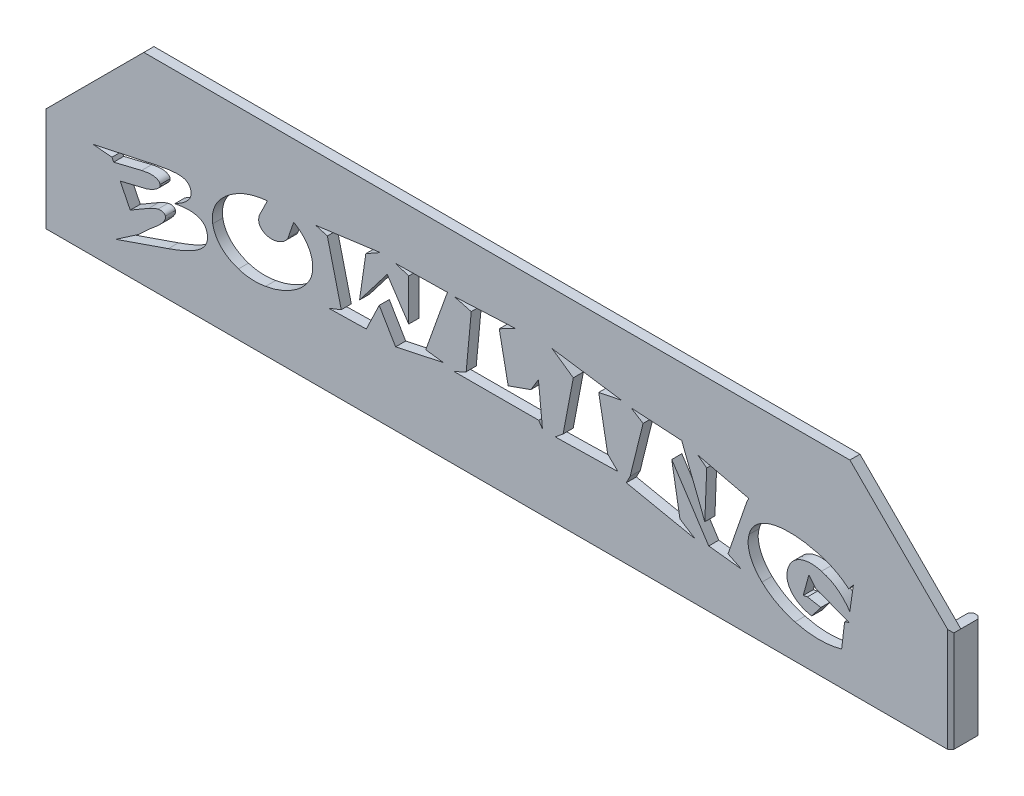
from build123d import *

# Parameters (mm, degrees)
BOSS_EXTRU_1_DEPTH      = 2
ENL_V_MAT_EXTRU_3_DEPTH = 10
ESQUISSE6_W             = 2
ESQUISSE6_H             = 20
BOSS_EXTRU_2_DEPTH      = 4
CHANFREIN1_SIZE         = 0.6


with BuildPart() as part:
    # Esquisse1 → Boss.-Extru.1 (new body)
    with BuildSketch(Plane.XY):
        Polygon((-90, 0), (90, 0), (90, 20), (70, 40), (-70, 40), (-90, 20), align=None)
    extrude(amount=BOSS_EXTRU_1_DEPTH)

    # Esquisse5 → Enl_v. mat.-Extru.3 (cut)
    with BuildSketch(Plane.XY.offset(2)):
        with BuildLine():
            Line((-65.13450329, 8.732218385), (-75.524175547, 5.136562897))
            Line((-75.524175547, 5.136562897), (-71.028177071, 8.226311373))
            Line((-71.028177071, 8.226311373), (-68.687285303, 10.401425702))
            add(Edge.make_bspline(
                [(-68.687285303, 10.401425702), (-68.428409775, 10.604698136), (-68.056893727, 10.905267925), (-67.589815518, 11.309111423), (-67.279108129, 11.588260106), (-66.994943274, 11.853941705), (-66.740007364, 12.108085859), (-66.514648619, 12.350787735), (-66.315874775, 12.579409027), (-66.145454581, 12.797559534), (-66.003835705, 13.005634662), (-65.883319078, 13.200111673), (-65.794696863, 13.385269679), (-65.73272996, 13.559562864), (-65.686047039, 13.769025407), (-65.691991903, 13.924687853), (-65.714724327, 14.019947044)],
                knots=[0, 0, 0, 0, 0.204199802, 0.296389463, 0.383025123, 0.46330879, 0.537702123, 0.606290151, 0.668732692, 0.725600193, 0.777897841, 0.824830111, 0.867394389, 0.904967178, 0.939395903, 1, 1, 1, 1], degree=3))
            add(Edge.make_bspline(
                [(-65.714724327, 14.019947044), (-65.743527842, 14.130607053), (-65.836961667, 14.288511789), (-66.043519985, 14.424958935), (-66.235972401, 14.502203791), (-66.457391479, 14.549341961), (-66.790686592, 14.568236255), (-67.046563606, 14.526508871), (-67.218154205, 14.48298058)],
                knots=[0, 0, 0, 0, 0.198118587, 0.30248799, 0.423844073, 0.555583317, 0.692800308, 1, 1, 1, 1], degree=3))
            add(Edge.make_bspline(
                [(-67.218154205, 14.48298058), (-67.511841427, 14.408046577), (-67.958206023, 14.237825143), (-68.559145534, 13.959921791), (-68.875938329, 13.790025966), (-69.035989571, 13.696966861)],
                knots=[0, 0, 0, 0, 0.457042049, 0.72046758, 1, 1, 1, 1], degree=3))
            Line((-69.035989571, 13.696966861), (-72.69590623, 11.568969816))
            Line((-72.69590623, 11.568969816), (-74.687422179, 15.560599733))
            Line((-74.687422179, 15.560599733), (-69.41899262, 16.84387997))
            add(Edge.make_bspline(
                [(-69.41899262, 16.84387997), (-69.023699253, 16.986915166), (-68.46614836, 17.214469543), (-67.799063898, 17.588162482), (-67.456972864, 17.827714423), (-67.224605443, 18.023549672), (-67.081239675, 18.162238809), (-66.96533043, 18.29871223), (-66.872325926, 18.428287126), (-66.807768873, 18.556487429), (-66.756154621, 18.716894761), (-66.761588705, 18.840570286), (-66.777986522, 18.916097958)],
                knots=[0, 0, 0, 0, 0.355459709, 0.507236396, 0.645273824, 0.707532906, 0.763891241, 0.813575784, 0.858686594, 0.898289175, 0.934453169, 1, 1, 1, 1], degree=3))
            add(Edge.make_bspline(
                [(-66.777986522, 18.916097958), (-66.803763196, 19.021834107), (-66.874553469, 19.170612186), (-67.012719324, 19.341417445), (-67.144095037, 19.451079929), (-67.301380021, 19.542366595), (-67.483081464, 19.619058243), (-67.688944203, 19.68169857), (-67.9190049, 19.72573712), (-68.169104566, 19.757298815), (-68.439406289, 19.770802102), (-68.727642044, 19.767714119), (-69.034592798, 19.746064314), (-69.359941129, 19.712617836), (-69.704035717, 19.660066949), (-70.066303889, 19.591443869), (-70.313165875, 19.535637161), (-70.439381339, 19.50489369)],
                knots=[0, 0, 0, 0, 0.080611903, 0.120925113, 0.162690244, 0.207200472, 0.255804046, 0.309189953, 0.36704195, 0.429928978, 0.496679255, 0.568302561, 0.64433919, 0.725623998, 0.811668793, 0.903319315, 1, 1, 1, 1], degree=3))
            Line((-70.439381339, 19.50489369), (-75.981769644, 18.15488278))
            Line((-75.981769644, 18.15488278), (-76.324480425, 18.841783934))
            Line((-76.324480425, 18.841783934), (-80.10020451, 19.17048058))
            Line((-80.10020451, 19.17048058), (-67.649747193, 21.860076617))
            add(Edge.make_bspline(
                [(-67.649747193, 21.860076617), (-67.098878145, 21.981133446), (-66.302307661, 22.134066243), (-65.279073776, 22.301071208), (-64.608949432, 22.387608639), (-64.000631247, 22.442450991), (-63.457028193, 22.470916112), (-62.975913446, 22.465905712), (-62.553984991, 22.434597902), (-62.18137105, 22.368649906), (-61.850638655, 22.272985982), (-61.558297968, 22.144671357), (-61.305087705, 21.983010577), (-61.091491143, 21.789169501), (-60.848925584, 21.487106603), (-60.74053512, 21.211612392), (-60.689952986, 21.022614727)],
                knots=[0, 0, 0, 0, 0.221363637, 0.318320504, 0.406917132, 0.486516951, 0.558024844, 0.620482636, 0.675266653, 0.723901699, 0.768748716, 0.810099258, 0.848792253, 0.886123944, 0.922860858, 1, 1, 1, 1], degree=3))
            add(Edge.make_bspline(
                [(-60.689952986, 21.022614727), (-60.649201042, 20.85747048), (-60.611952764, 20.603114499), (-60.636297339, 20.264036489), (-60.685730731, 20.0127296), (-60.766437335, 19.76200604), (-60.881689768, 19.512630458), (-61.031961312, 19.266551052), (-61.214234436, 19.022994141), (-61.426612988, 18.77769136), (-61.677774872, 18.537164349), (-61.956637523, 18.289877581), (-62.2734066, 18.047901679), (-62.622396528, 17.804619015), (-63.151337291, 17.472539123), (-63.569019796, 17.230139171), (-63.865448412, 17.081113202)],
                knots=[0, 0, 0, 0, 0.093707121, 0.139930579, 0.186385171, 0.234280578, 0.284460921, 0.337127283, 0.392572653, 0.451632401, 0.515372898, 0.583700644, 0.656551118, 0.734472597, 0.81763157, 1, 1, 1, 1], degree=3))
            add(Edge.make_bspline(
                [(-63.865448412, 17.081113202), (-63.431587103, 17.174871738), (-62.794833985, 17.279259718), (-61.965159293, 17.374889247), (-61.398227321, 17.404827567), (-60.865889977, 17.409607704), (-60.368916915, 17.38336599), (-59.907780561, 17.319505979), (-59.482339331, 17.230515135), (-59.095092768, 17.106718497), (-58.742567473, 16.957729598), (-58.432203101, 16.770250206), (-58.160437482, 16.554841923), (-57.927020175, 16.309050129), (-57.671636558, 15.930456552), (-57.544468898, 15.607507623), (-57.485875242, 15.383323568)],
                knots=[0, 0, 0, 0, 0.182781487, 0.265700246, 0.343927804, 0.416542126, 0.484950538, 0.548730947, 0.6081639, 0.66377496, 0.71598391, 0.765459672, 0.812659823, 0.858475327, 0.904525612, 1, 1, 1, 1], degree=3))
            add(Edge.make_bspline(
                [(-57.485875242, 15.383323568), (-57.404472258, 15.072708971), (-57.344069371, 14.595914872), (-57.413456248, 13.969054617), (-57.539600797, 13.520576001), (-57.733662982, 13.084316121), (-58.000186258, 12.66184647), (-58.338617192, 12.254168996), (-58.75126669, 11.860404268), (-59.241681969, 11.471313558), (-59.819349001, 11.084127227), (-60.485679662, 10.695002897), (-61.241442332, 10.302645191), (-62.087046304, 9.911833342), (-63.383513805, 9.35823904), (-64.416417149, 8.982683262), (-65.13450329, 8.732218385)],
                knots=[0, 0, 0, 0, 0.086801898, 0.12825484, 0.169667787, 0.212198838, 0.256845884, 0.304215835, 0.355015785, 0.410703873, 0.4731853, 0.542773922, 0.61912104, 0.703203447, 0.794445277, 1, 1, 1, 1], degree=3))
        make_face()
        Polygon((-10.18802533, 27.847546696), (-14.095228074, 16.886228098), (-10.611043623, 16.431769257), (-20.080365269, 14.390991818), (-23.327316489, 19.90166255), (-25.894008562, 14.54533633), (-33.319694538, 14.396708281), (-30.855898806, 15.38279822), (-33.614092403, 26.664238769), (-35.923543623, 27.344497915), (-23.101516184, 29.070869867), (-25.985471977, 27.450252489), (-27.234519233, 18.855549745), (-21.743856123, 26.026853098), (-17.476516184, 19.598689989), (-17.476516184, 27.864696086), (-20.108947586, 28.72502383), (-9.77506906, 28.894431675), align=None)
        Polygon((9.043616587, 14.835604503), (8.306081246, 15.97926476), (-8.417432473, 15.956398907), (-6.087973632, 17.102549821), (-5.079017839, 27.949539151), (-8.463164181, 28.849882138), (3.695753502, 29.432961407), (0.465951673, 27.766612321), (2.240913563, 18.863220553), (6.728337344, 20.446680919), (8.240341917, 22.927626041), align=None)
        Polygon((24.013328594, 15.011597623), (11.578769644, 14.759932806), (13.134551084, 16.038920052), (15.158179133, 26.697266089), (10.950862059, 29.615520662), (24.729667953, 27.624936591), (20.197241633, 26.708699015), (21.977919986, 17.005002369), align=None)
        Polygon((49.956832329, 23.383358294), (49.582721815, 22.656325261), (45.835580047, 11.815052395), (48.465153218, 10.514556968), (42.014124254, 11.246264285), (34.67418523, 22.427666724), (36.309093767, 13.01265148), (39.318811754, 11.114785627), (25.665689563, 13.925723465), (26.427868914, 15.42604122), (28.991702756, 25.787131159), (26.630275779, 27.263524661), (36.646047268, 26.673182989), (41.233509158, 15.011597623), (41.610795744, 24.440904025), (39.792960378, 25.795705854), align=None)
        with BuildLine():
            Line((69.867169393, 12.037438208), (68.94326422, 11.679878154))
            Line((68.94326422, 11.679878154), (68.363043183, 6.709413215))
            add(Edge.make_bspline(
                [(68.363043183, 6.709413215), (67.605404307, 6.506307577), (66.455011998, 6.277967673), (64.907979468, 6.128195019), (63.754413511, 6.092544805), (62.599967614, 6.139816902), (61.041160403, 6.305065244), (59.881853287, 6.550415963), (59.113805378, 6.755144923)],
                knots=[0, 0, 0, 0, 0.251400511, 0.375055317, 0.497884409, 0.621061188, 0.745143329, 1, 1, 1, 1], degree=3))
            add(Edge.make_bspline(
                [(59.113805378, 6.755144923), (58.484983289, 6.925666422), (57.558436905, 7.228033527), (56.37406927, 7.744221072), (55.52021652, 8.170406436), (54.707073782, 8.642976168), (53.696065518, 9.326484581), (52.991720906, 9.898374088), (52.559880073, 10.313643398)],
                knots=[0, 0, 0, 0, 0.259529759, 0.387329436, 0.514260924, 0.639410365, 0.761595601, 1, 1, 1, 1], degree=3))
            add(Edge.make_bspline(
                [(52.559880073, 10.313643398), (52.292576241, 10.578790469), (51.901241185, 10.976805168), (51.442758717, 11.547356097), (51.13097986, 11.970976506), (50.855010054, 12.402537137), (50.607368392, 12.837874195), (50.392720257, 13.278973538), (50.208825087, 13.724315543), (50.061645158, 14.17177478), (49.944138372, 14.616997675), (49.869393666, 15.060149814), (49.820879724, 15.500078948), (49.812295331, 15.937242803), (49.85288317, 16.51621829), (49.926190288, 16.945291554), (50.004620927, 17.224847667)],
                knots=[0, 0, 0, 0, 0.146092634, 0.215955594, 0.28363402, 0.34992934, 0.414440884, 0.477714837, 0.540000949, 0.601093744, 0.66022532, 0.718343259, 0.775168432, 0.831696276, 0.887596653, 1, 1, 1, 1], degree=3))
            add(Edge.make_bspline(
                [(50.004620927, 17.224847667), (50.073896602, 17.484769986), (50.206694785, 17.864913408), (50.445674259, 18.341238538), (50.649844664, 18.680640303), (50.880325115, 19.004303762), (51.143609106, 19.307289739), (51.429128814, 19.597791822), (51.74478508, 19.868637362), (52.084672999, 20.122679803), (52.447791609, 20.358020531), (52.836292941, 20.568553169), (53.244981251, 20.763762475), (53.678404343, 20.938185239), (54.296608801, 21.146937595), (54.780768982, 21.262690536), (55.109422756, 21.33212663)],
                knots=[0, 0, 0, 0, 0.116605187, 0.173858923, 0.230731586, 0.288148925, 0.345843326, 0.404540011, 0.464564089, 0.525932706, 0.588363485, 0.651942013, 0.717334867, 0.784590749, 0.854329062, 1, 1, 1, 1], degree=3))
            add(Edge.make_bspline(
                [(55.109422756, 21.33212663), (55.762182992, 21.468305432), (56.768329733, 21.589932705), (58.13634771, 21.632297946), (59.20612216, 21.595241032), (60.308609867, 21.499295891), (61.848073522, 21.268863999), (63.009021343, 21.012908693), (63.78701422, 20.800495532)],
                knots=[0, 0, 0, 0, 0.227878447, 0.345900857, 0.467842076, 0.593793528, 0.724218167, 1, 1, 1, 1], degree=3))
            add(Edge.make_bspline(
                [(63.78701422, 20.800495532), (64.371318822, 20.641343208), (65.229205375, 20.371736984), (66.323233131, 19.916718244), (67.100038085, 19.551628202), (67.832840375, 19.147196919), (68.743366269, 18.585715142), (69.369862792, 18.101230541), (69.760718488, 17.759336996)],
                knots=[0, 0, 0, 0, 0.268827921, 0.398299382, 0.525575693, 0.649511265, 0.769527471, 1, 1, 1, 1], degree=3))
            Line((69.760718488, 17.759336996), (70.686785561, 18.899771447))
            Line((70.686785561, 18.899771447), (69.982395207, 13.925723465))
            add(Edge.make_bspline(
                [(69.982395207, 13.925723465), (69.891331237, 14.111452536), (69.652026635, 14.405173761), (69.323337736, 14.835321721), (69.000683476, 15.214908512), (68.668195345, 15.569051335), (68.330948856, 15.902313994), (67.984834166, 16.210417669), (67.631728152, 16.498456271), (67.268230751, 16.764611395), (66.892093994, 17.011247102), (66.504085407, 17.239611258), (66.102871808, 17.449480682), (65.687744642, 17.636774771), (65.116555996, 17.868369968), (64.672912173, 18.007875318), (64.37295172, 18.090891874)],
                knots=[0, 0, 0, 0, 0.08657316, 0.157745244, 0.227509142, 0.295385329, 0.361530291, 0.426363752, 0.489731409, 0.552654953, 0.615297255, 0.678370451, 0.741485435, 0.805170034, 0.869379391, 1, 1, 1, 1], degree=3))
            add(Edge.make_bspline(
                [(64.37295172, 18.090891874), (63.979539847, 18.196424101), (63.392511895, 18.317456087), (62.614452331, 18.39001345), (62.063402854, 18.394261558), (61.531985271, 18.346694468), (61.019182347, 18.260905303), (60.526044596, 18.122019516), (60.057618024, 17.936679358), (59.616041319, 17.713025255), (59.215019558, 17.445107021), (58.850238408, 17.143883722), (58.528144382, 16.800767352), (58.247531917, 16.419526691), (57.923605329, 15.849711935), (57.747376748, 15.38218756), (57.661823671, 15.055449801)],
                knots=[0, 0, 0, 0, 0.147599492, 0.216574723, 0.282854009, 0.346954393, 0.409664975, 0.470975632, 0.532193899, 0.591941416, 0.649960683, 0.706578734, 0.76299015, 0.820019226, 0.877693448, 1, 1, 1, 1], degree=3))
            add(Edge.make_bspline(
                [(57.661823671, 15.055449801), (57.582103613, 14.765538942), (57.510293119, 14.323943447), (57.513444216, 13.737223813), (57.564529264, 13.312886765), (57.668415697, 12.898145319), (57.825180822, 12.493436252), (58.028442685, 12.096538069), (58.284594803, 11.715556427), (58.578846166, 11.351570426), (58.914254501, 11.015009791), (59.283808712, 10.705060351), (59.691458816, 10.425451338), (60.133821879, 10.172509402), (60.787385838, 9.870276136), (61.309108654, 9.690862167), (61.671922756, 9.59622724)],
                knots=[0, 0, 0, 0, 0.118796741, 0.175660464, 0.231430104, 0.287325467, 0.344182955, 0.402624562, 0.463201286, 0.525307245, 0.587350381, 0.650705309, 0.715676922, 0.782469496, 0.851878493, 1, 1, 1, 1], degree=3))
            add(Edge.make_bspline(
                [(61.671922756, 9.59622724), (61.707740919, 9.590035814), (61.772335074, 9.569995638), (61.877856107, 9.549186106), (62.097201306, 9.49919773), (62.287639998, 9.462979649), (62.437928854, 9.430449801)],
                knots=[0, 0, 0, 0, 0.138889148, 0.258338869, 0.411408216, 1, 1, 1, 1], degree=3))
            Line((62.437928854, 9.430449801), (64.241473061, 11.799923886))
            Line((64.241473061, 11.799923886), (61.57760111, 12.282965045))
            Line((61.57760111, 12.282965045), (60.738957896, 12.105754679))
            Line((60.738957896, 12.105754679), (61.869140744, 16.21017541))
            Line((61.869140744, 16.21017541), (63.22197525, 14.54533633))
            Line((63.22197525, 14.54533633), (69.867169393, 12.037438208))
        make_face()
        with BuildLine():
            Line((-46.774158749, 24.155334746), (-45.496529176, 26.744892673))
            Line((-45.496529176, 26.744892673), (-46.902779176, 26.579115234))
            add(Edge.make_bspline(
                [(-54.531399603, 22.666196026), (-54.304551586, 22.918563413), (-53.935820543, 23.272067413), (-53.421426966, 23.723870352), (-53.008624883, 24.040689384), (-52.581722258, 24.349779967), (-52.133840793, 24.639903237), (-51.665510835, 24.914473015), (-51.181827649, 25.176890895), (-50.682436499, 25.422494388), (-50.171051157, 25.647789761), (-49.650474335, 25.853741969), (-49.120517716, 26.04021859), (-48.580640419, 26.205432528), (-47.844218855, 26.401372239), (-47.281698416, 26.51551794), (-46.902779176, 26.579115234)],
                knots=[0, 0, 0, 0, 0.116521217, 0.175487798, 0.235231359, 0.29530611, 0.356620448, 0.418571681, 0.481874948, 0.545732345, 0.609808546, 0.673906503, 0.738123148, 0.80286789, 0.867926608, 1, 1, 1, 1], degree=3))
            add(Edge.make_bspline(
                [(-56.340660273, 17.404191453), (-56.416645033, 17.852984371), (-56.445196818, 18.541091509), (-56.311470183, 19.450452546), (-56.119317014, 20.126799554), (-55.848232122, 20.794212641), (-55.359609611, 21.676462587), (-54.888332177, 22.286269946), (-54.531399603, 22.666196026)],
                knots=[0, 0, 0, 0, 0.236513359, 0.355212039, 0.476628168, 0.601298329, 0.729020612, 1, 1, 1, 1], degree=3))
            add(Edge.make_bspline(
                [(-51.241574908, 12.190776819), (-51.585511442, 12.305332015), (-52.088784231, 12.49434834), (-52.723879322, 12.805264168), (-53.169343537, 13.053527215), (-53.592312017, 13.319936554), (-53.990449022, 13.608156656), (-54.360880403, 13.920714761), (-54.708964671, 14.248616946), (-55.023982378, 14.597184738), (-55.312466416, 14.956989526), (-55.563475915, 15.333092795), (-55.785470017, 15.720233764), (-55.974344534, 16.121781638), (-56.185636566, 16.676362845), (-56.290471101, 17.110927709), (-56.340660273, 17.404191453)],
                knots=[0, 0, 0, 0, 0.141748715, 0.209699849, 0.276216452, 0.340993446, 0.404977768, 0.468153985, 0.530317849, 0.591740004, 0.651643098, 0.71041151, 0.768287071, 0.825924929, 0.883675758, 1, 1, 1, 1], degree=3))
            add(Edge.make_bspline(
                [(-45.862382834, 11.89066249), (-46.341556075, 11.814176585), (-47.056213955, 11.722587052), (-48.003102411, 11.693060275), (-48.687614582, 11.708068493), (-49.353570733, 11.769959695), (-50.211754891, 11.895547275), (-50.836175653, 12.060146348), (-51.241574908, 12.190776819)],
                knots=[0, 0, 0, 0, 0.26770418, 0.396483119, 0.52208093, 0.644983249, 0.765048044, 1, 1, 1, 1], degree=3))
            add(Edge.make_bspline(
                [(-37.319128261, 16.984031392), (-37.510405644, 16.667198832), (-37.838916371, 16.211829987), (-38.337483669, 15.644204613), (-38.755109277, 15.232299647), (-39.205606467, 14.832466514), (-39.694251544, 14.447908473), (-40.219578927, 14.080391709), (-40.778651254, 13.731182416), (-41.359870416, 13.400169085), (-41.962575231, 13.101423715), (-42.57610227, 12.824852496), (-43.207110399, 12.583468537), (-43.849354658, 12.365600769), (-44.730156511, 12.111653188), (-45.405924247, 11.968108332), (-45.862382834, 11.89066249)],
                knots=[0, 0, 0, 0, 0.108446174, 0.164268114, 0.221359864, 0.280336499, 0.340810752, 0.403590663, 0.468237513, 0.534042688, 0.5996364, 0.665417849, 0.731308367, 0.797656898, 0.864237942, 1, 1, 1, 1], degree=3))
            add(Edge.make_bspline(
                [(-36.593137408, 20.794054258), (-36.534623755, 20.460109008), (-36.493061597, 19.957092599), (-36.52189761, 19.292225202), (-36.591601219, 18.810138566), (-36.703620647, 18.33730399), (-36.91539855, 17.713202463), (-37.143367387, 17.268414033), (-37.319128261, 16.984031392)],
                knots=[0, 0, 0, 0, 0.256181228, 0.380223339, 0.502478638, 0.623918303, 0.747165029, 1, 1, 1, 1], degree=3))
            add(Edge.make_bspline(
                [(-40.289431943, 25.691041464), (-40.285419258, 25.688859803), (-40.132103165, 25.605374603), (-39.834647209, 25.433859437), (-39.417983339, 25.145532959), (-39.018868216, 24.836803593), (-38.640909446, 24.502420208), (-38.288561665, 24.142580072), (-37.959831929, 23.766693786), (-37.662416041, 23.376915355), (-37.40228038, 22.972753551), (-37.167079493, 22.562323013), (-36.975291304, 22.134693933), (-36.754706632, 21.553676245), (-36.644513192, 21.100035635), (-36.593137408, 20.794054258)],
                knots=[0.197348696, 0.197348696, 0.197348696, 0.197348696, 0.199080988, 0.263558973, 0.327528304, 0.391158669, 0.454920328, 0.518824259, 0.582108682, 0.644284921, 0.704644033, 0.764367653, 0.823572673, 0.88225451, 1, 1, 1, 1], degree=3))
            Line((-40.289431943, 25.691041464), (-41.394966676, 22.480410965))
            add(Edge.make_bspline(
                [(-44.035972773, 20.668292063), (-43.741502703, 20.716251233), (-43.308580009, 20.837085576), (-42.768752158, 21.08990704), (-42.392293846, 21.319251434), (-42.055157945, 21.577479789), (-41.687986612, 21.9407231), (-41.482981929, 22.256421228), (-41.394966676, 22.480410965)],
                knots=[0, 0, 0, 0, 0.268677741, 0.40232359, 0.536005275, 0.665130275, 0.784105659, 1, 1, 1, 1], degree=3))
            add(Edge.make_bspline(
                [(-47.191460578, 22.263185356), (-47.167862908, 22.126628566), (-47.108470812, 21.92554647), (-46.977412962, 21.679530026), (-46.854318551, 21.506581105), (-46.70209658, 21.349778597), (-46.531437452, 21.198942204), (-46.330986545, 21.066620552), (-46.113660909, 20.940723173), (-45.879111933, 20.833741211), (-45.634037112, 20.747449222), (-45.382482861, 20.682209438), (-45.124632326, 20.635353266), (-44.860548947, 20.613612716), (-44.495958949, 20.609598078), (-44.220241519, 20.638123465), (-44.035972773, 20.668292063)],
                knots=[0, 0, 0, 0, 0.106570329, 0.159653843, 0.21372376, 0.269165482, 0.327322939, 0.388475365, 0.453435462, 0.52030033, 0.586325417, 0.652949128, 0.719906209, 0.787548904, 0.856406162, 1, 1, 1, 1], degree=3))
            add(Edge.make_bspline(
                [(-46.774158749, 24.155334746), (-46.867709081, 24.007292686), (-46.984354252, 23.775111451), (-47.106916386, 23.455282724), (-47.168727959, 23.214371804), (-47.209535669, 22.974330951), (-47.231189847, 22.656489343), (-47.220978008, 22.418713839), (-47.191460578, 22.263185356)],
                knots=[0, 0, 0, 0, 0.264849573, 0.392709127, 0.518018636, 0.640911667, 0.761002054, 1, 1, 1, 1], degree=3))
        make_face()
    extrude(amount=-ENL_V_MAT_EXTRU_3_DEPTH, mode=Mode.SUBTRACT)

    # Esquisse6 → Boss.-Extru.2 (add)
    with BuildSketch(Plane(origin=(0, 0, 0), x_dir=(-1, 0, 0), z_dir=(0, 0, -1))):
        with Locations((-89, 10)):
            Rectangle(ESQUISSE6_W, ESQUISSE6_H)
        with Locations((89, 10)):
            Rectangle(ESQUISSE6_W, ESQUISSE6_H)
    extrude(amount=BOSS_EXTRU_2_DEPTH)

    # Chanfrein1
    chanfrein1_edges = [part.edges().sort_by_distance(p)[0] for p in [
        (90, 10, 2),
        (-90, 10, 2),
        (90, 10, -4),
        (88, 10, -4),
        (-90, 10, -4),
        (-88, 10, -4),
    ]]
    chamfer(chanfrein1_edges, length=CHANFREIN1_SIZE)


solid = part.part
